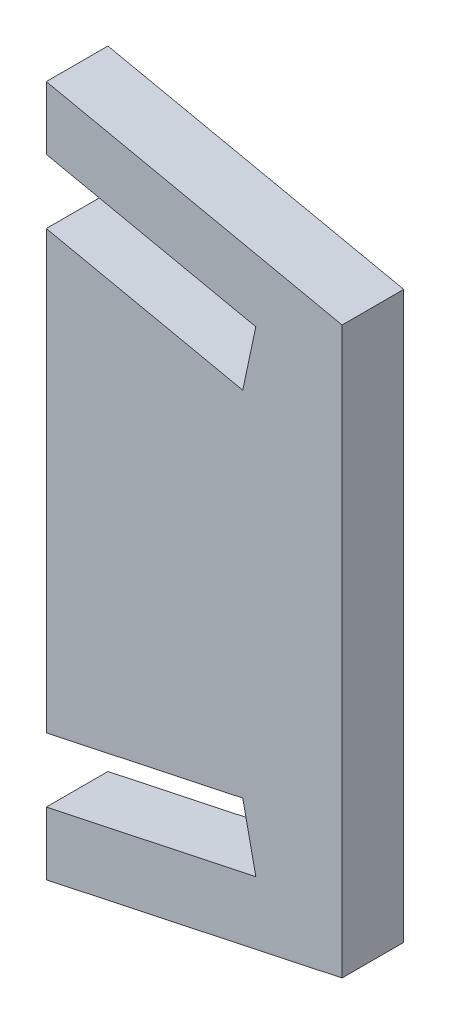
from build123d import *

# Parameters (mm, degrees)
ESQUISSE1_W             = 48
ESQUISSE1_H             = 130
BOSS_EXTRU_1_DEPTH      = 10
ENL_V_MAT_EXTRU_1_DEPTH = 10
ENL_V_MAT_EXTRU_2_DEPTH = 10


with BuildPart() as part:
    # Esquisse1 → Boss.-Extru.1 (new body)
    with BuildSketch(Plane.XY):
        with Locations((-24, 65)):
            Rectangle(ESQUISSE1_W, ESQUISSE1_H)
    extrude(amount=BOSS_EXTRU_1_DEPTH)

    # Esquisse2 → Enl_v. mat.-Extru.1 (cut)
    with BuildSketch(Plane.XY.offset(10)):
        Polygon((-48, 110.864028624), (-14, 103.637105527), (-16.120699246, 93.66), (-48, 100.436154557), align=None)
        Polygon((-48, 29.563845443), (-48, 19.135971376), (-14, 26.362894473), (-16.120699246, 36.34), align=None)
    extrude(amount=-ENL_V_MAT_EXTRU_1_DEPTH, mode=Mode.SUBTRACT)

    # Esquisse3 → Enl_v. mat.-Extru.2 (cut)
    with BuildSketch(Plane.XY.offset(10)):
        Polygon((-89.930323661, 130), (0, 110.884719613), (0, 130), align=None)
        Polygon((0, 0), (-89.930323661, 0), (0, 19.115280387), align=None)
    extrude(amount=-ENL_V_MAT_EXTRU_2_DEPTH, mode=Mode.SUBTRACT)


solid = part.part
